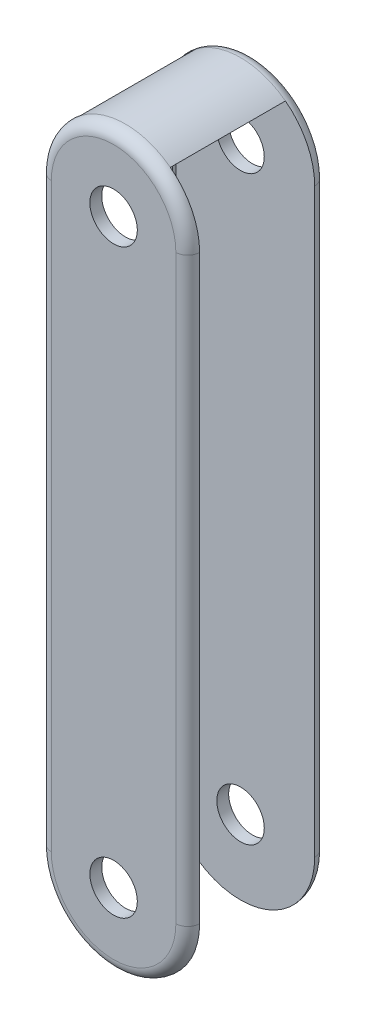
ISO-10303-21;
HEADER;
FILE_DESCRIPTION(('STEP AP214'),'2;1');
FILE_NAME('part.step','',(''),(''),'','','');
FILE_SCHEMA(('AUTOMOTIVE_DESIGN { 1 0 10303 214 1 1 1 1 }'));
ENDSEC;
DATA;
#1=APPLICATION_CONTEXT('core data for automotive mechanical design processes');
#2=APPLICATION_PROTOCOL_DEFINITION('international standard','automotive_design',2000,#1);
#3=PRODUCT_CONTEXT('',#1,'mechanical');
#4=PRODUCT('Part','Part','',(#3));
#5=PRODUCT_RELATED_PRODUCT_CATEGORY('part','',(#4));
#6=PRODUCT_DEFINITION_FORMATION('','',#4);
#7=PRODUCT_DEFINITION_CONTEXT('part definition',#1,'design');
#8=PRODUCT_DEFINITION('design','',#6,#7);
#9=PRODUCT_DEFINITION_SHAPE('','',#8);
#10=(LENGTH_UNIT() NAMED_UNIT(*) SI_UNIT(.MILLI.,.METRE.));
#11=(NAMED_UNIT(*) PLANE_ANGLE_UNIT() SI_UNIT($,.RADIAN.));
#12=(NAMED_UNIT(*) SI_UNIT($,.STERADIAN.) SOLID_ANGLE_UNIT());
#13=UNCERTAINTY_MEASURE_WITH_UNIT(LENGTH_MEASURE(1.E-05),#10,'distance_accuracy_value','');
#14=(GEOMETRIC_REPRESENTATION_CONTEXT(3) GLOBAL_UNCERTAINTY_ASSIGNED_CONTEXT((#13)) GLOBAL_UNIT_ASSIGNED_CONTEXT((#10,
#11,#12)) REPRESENTATION_CONTEXT('',''));
#15=CARTESIAN_POINT('',(0.,0.,0.));
#16=DIRECTION('',(0.,0.,1.));
#17=DIRECTION('',(1.,0.,0.));
#18=AXIS2_PLACEMENT_3D('',#15,#16,#17);
#19=CARTESIAN_POINT('',(6.25,49.,11.7));
#20=DIRECTION('',(0.,0.,-1.));
#21=DIRECTION('',(-1.,0.,0.));
#22=AXIS2_PLACEMENT_3D('',#19,#20,#21);
#23=CYLINDRICAL_SURFACE('',#22,6.25);
#24=DIRECTION('',(0.,0.,-1.));
#25=VECTOR('',#24,1.);
#26=CARTESIAN_POINT('',(0.0723164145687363,49.9480113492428,11.7));
#27=LINE('',#26,#25);
#28=CARTESIAN_POINT('',(0.0723164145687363,49.9480113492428,1.3));
#29=VERTEX_POINT('',#28);
#30=CARTESIAN_POINT('',(0.0723164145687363,49.9480113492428,9.3));
#31=VERTEX_POINT('',#30);
#32=EDGE_CURVE('E296',#29,#31,#27,.F.);
#33=ORIENTED_EDGE('',*,*,#32,.T.);
#34=CARTESIAN_POINT('',(6.25,49.,9.3));
#35=DIRECTION('',(0.,0.,1.));
#36=DIRECTION('',(1.,0.,0.));
#37=AXIS2_PLACEMENT_3D('',#34,#35,#36);
#38=CIRCLE('',#37,6.25);
#39=CARTESIAN_POINT('',(0.,49.,9.3));
#40=VERTEX_POINT('',#39);
#41=EDGE_CURVE('E293',#31,#40,#38,.T.);
#42=ORIENTED_EDGE('',*,*,#41,.T.);
#43=DIRECTION('',(0.,0.,-1.));
#44=VECTOR('',#43,1.);
#45=CARTESIAN_POINT('',(0.,49.,11.7));
#46=LINE('',#45,#44);
#47=CARTESIAN_POINT('',(0.,49.,10.7));
#48=VERTEX_POINT('',#47);
#49=EDGE_CURVE('E322',#48,#40,#46,.T.);
#50=ORIENTED_EDGE('',*,*,#49,.F.);
#51=CARTESIAN_POINT('',(6.25,49.,10.7));
#52=DIRECTION('',(0.,0.,-1.));
#53=DIRECTION('',(-1.,0.,0.));
#54=AXIS2_PLACEMENT_3D('',#51,#52,#53);
#55=CIRCLE('',#54,6.25);
#56=CARTESIAN_POINT('',(0.800000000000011,52.0594117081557,10.7));
#57=VERTEX_POINT('',#56);
#58=EDGE_CURVE('E205',#48,#57,#55,.T.);
#59=ORIENTED_EDGE('',*,*,#58,.T.);
#60=DIRECTION('',(0.,0.,-1.));
#61=VECTOR('',#60,1.);
#62=CARTESIAN_POINT('',(0.800000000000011,52.0594117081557,11.7));
#63=LINE('',#62,#61);
#64=CARTESIAN_POINT('',(0.800000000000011,52.0594117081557,1.));
#65=VERTEX_POINT('',#64);
#66=EDGE_CURVE('E307',#65,#57,#63,.F.);
#67=ORIENTED_EDGE('',*,*,#66,.F.);
#68=CARTESIAN_POINT('',(6.25,49.,1.));
#69=DIRECTION('',(0.,0.,-1.));
#70=DIRECTION('',(-1.,0.,0.));
#71=AXIS2_PLACEMENT_3D('',#68,#69,#70);
#72=CIRCLE('',#71,6.25);
#73=CARTESIAN_POINT('',(0.,49.,1.));
#74=VERTEX_POINT('',#73);
#75=EDGE_CURVE('E233',#65,#74,#72,.F.);
#76=ORIENTED_EDGE('',*,*,#75,.T.);
#77=CARTESIAN_POINT('',(0.,49.,1.3));
#78=VERTEX_POINT('',#77);
#79=EDGE_CURVE('E220',#78,#74,#46,.T.);
#80=ORIENTED_EDGE('',*,*,#79,.F.);
#81=CARTESIAN_POINT('',(6.25,49.,1.3));
#82=DIRECTION('',(0.,0.,-1.));
#83=DIRECTION('',(0.,1.,0.));
#84=AXIS2_PLACEMENT_3D('',#81,#82,#83);
#85=CIRCLE('',#84,6.25);
#86=EDGE_CURVE('E60',#78,#29,#85,.T.);
#87=ORIENTED_EDGE('',*,*,#86,.T.);
#88=EDGE_LOOP('',(#33,#42,#50,#59,#67,#76,#80,#87));
#89=FACE_BOUND('',#88,.T.);
#90=ADVANCED_FACE('F35',(#89),#23,.T.);
#91=CARTESIAN_POINT('',(2.46620715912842,53.9744760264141,10.7));
#92=VERTEX_POINT('',#91);
#93=CARTESIAN_POINT('',(10.0337928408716,53.9744760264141,10.7));
#94=VERTEX_POINT('',#93);
#95=EDGE_CURVE('E204',#92,#94,#55,.T.);
#96=ORIENTED_EDGE('',*,*,#95,.T.);
#97=DIRECTION('',(0.,0.,-1.));
#98=VECTOR('',#97,1.);
#99=CARTESIAN_POINT('',(10.0337928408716,53.9744760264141,11.7));
#100=LINE('',#99,#98);
#101=CARTESIAN_POINT('',(10.0337928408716,53.9744760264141,1.));
#102=VERTEX_POINT('',#101);
#103=EDGE_CURVE('E317',#94,#102,#100,.T.);
#104=ORIENTED_EDGE('',*,*,#103,.T.);
#105=CARTESIAN_POINT('',(2.46620715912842,53.9744760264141,1.));
#106=VERTEX_POINT('',#105);
#107=EDGE_CURVE('E237',#102,#106,#72,.F.);
#108=ORIENTED_EDGE('',*,*,#107,.T.);
#109=DIRECTION('',(0.,0.,-1.));
#110=VECTOR('',#109,1.);
#111=CARTESIAN_POINT('',(2.46620715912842,53.9744760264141,11.7));
#112=LINE('',#111,#110);
#113=EDGE_CURVE('E314',#106,#92,#112,.F.);
#114=ORIENTED_EDGE('',*,*,#113,.T.);
#115=EDGE_LOOP('',(#96,#104,#108,#114));
#116=FACE_BOUND('',#115,.T.);
#117=ADVANCED_FACE('F350',(#116),#23,.T.);
#118=CARTESIAN_POINT('',(0.,0.,11.7));
#119=DIRECTION('',(1.,0.,0.));
#120=DIRECTION('',(0.,0.,-1.));
#121=AXIS2_PLACEMENT_3D('',#118,#119,#120);
#122=PLANE('',#121);
#123=DIRECTION('',(0.,-1.,0.));
#124=VECTOR('',#123,1.);
#125=CARTESIAN_POINT('',(0.,0.,1.));
#126=LINE('',#125,#124);
#127=CARTESIAN_POINT('',(0.,3.54999999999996,1.));
#128=VERTEX_POINT('',#127);
#129=EDGE_CURVE('E189',#74,#128,#126,.T.);
#130=ORIENTED_EDGE('',*,*,#129,.T.);
#131=DIRECTION('',(0.,0.,-1.));
#132=VECTOR('',#131,1.);
#133=CARTESIAN_POINT('',(0.,3.54999999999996,10.7));
#134=LINE('',#133,#132);
#135=CARTESIAN_POINT('',(0.,3.54999999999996,10.7));
#136=VERTEX_POINT('',#135);
#137=EDGE_CURVE('E175',#136,#128,#134,.T.);
#138=ORIENTED_EDGE('',*,*,#137,.F.);
#139=DIRECTION('',(0.,-1.,0.));
#140=VECTOR('',#139,1.);
#141=CARTESIAN_POINT('',(0.,0.,10.7));
#142=LINE('',#141,#140);
#143=EDGE_CURVE('E169',#136,#48,#142,.F.);
#144=ORIENTED_EDGE('',*,*,#143,.T.);
#145=ORIENTED_EDGE('',*,*,#49,.T.);
#146=DIRECTION('',(0.,1.,0.));
#147=VECTOR('',#146,1.);
#148=CARTESIAN_POINT('',(0.,15.15,9.3));
#149=LINE('',#148,#147);
#150=CARTESIAN_POINT('',(0.,15.15,9.3));
#151=VERTEX_POINT('',#150);
#152=EDGE_CURVE('E281',#151,#40,#149,.T.);
#153=ORIENTED_EDGE('',*,*,#152,.F.);
#154=CARTESIAN_POINT('',(0.,15.15,5.3));
#155=DIRECTION('',(-1.,0.,0.));
#156=DIRECTION('',(0.,0.,-1.));
#157=AXIS2_PLACEMENT_3D('',#154,#155,#156);
#158=CIRCLE('',#157,4.);
#159=CARTESIAN_POINT('',(0.,15.15,1.3));
#160=VERTEX_POINT('',#159);
#161=EDGE_CURVE('E278',#160,#151,#158,.T.);
#162=ORIENTED_EDGE('',*,*,#161,.F.);
#163=DIRECTION('',(0.,-1.,0.));
#164=VECTOR('',#163,1.);
#165=CARTESIAN_POINT('',(0.,49.9480113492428,1.3));
#166=LINE('',#165,#164);
#167=EDGE_CURVE('E276',#78,#160,#166,.T.);
#168=ORIENTED_EDGE('',*,*,#167,.F.);
#169=ORIENTED_EDGE('',*,*,#79,.T.);
#170=EDGE_LOOP('',(#130,#138,#144,#145,#153,#162,#168,#169));
#171=FACE_BOUND('',#170,.T.);
#172=ADVANCED_FACE('F185',(#171),#122,.F.);
#173=CARTESIAN_POINT('',(6.25,0.,11.7));
#174=DIRECTION('',(0.,0.,-1.));
#175=DIRECTION('',(-1.,0.,0.));
#176=AXIS2_PLACEMENT_3D('',#173,#174,#175);
#177=PLANE('',#176);
#178=CARTESIAN_POINT('',(6.25,49.,11.7));
#179=DIRECTION('',(0.,0.,1.));
#180=DIRECTION('',(1.,0.,0.));
#181=AXIS2_PLACEMENT_3D('',#178,#179,#180);
#182=CIRCLE('',#181,2.);
#183=CARTESIAN_POINT('',(8.25,49.,11.7));
#184=VERTEX_POINT('',#183);
#185=EDGE_CURVE('E416',#184,#184,#182,.T.);
#186=ORIENTED_EDGE('',*,*,#185,.F.);
#187=EDGE_LOOP('',(#186));
#188=FACE_BOUND('',#187,.T.);
#189=CARTESIAN_POINT('',(6.25,0.,11.7));
#190=DIRECTION('',(0.,0.,1.));
#191=DIRECTION('',(1.,0.,0.));
#192=AXIS2_PLACEMENT_3D('',#189,#190,#191);
#193=CIRCLE('',#192,2.);
#194=CARTESIAN_POINT('',(8.25,0.,11.7));
#195=VERTEX_POINT('',#194);
#196=EDGE_CURVE('E263',#195,#195,#193,.T.);
#197=ORIENTED_EDGE('',*,*,#196,.F.);
#198=EDGE_LOOP('',(#197));
#199=FACE_BOUND('',#198,.T.);
#200=CARTESIAN_POINT('',(6.25,49.,11.7));
#201=DIRECTION('',(0.,0.,-1.));
#202=DIRECTION('',(-1.,0.,0.));
#203=AXIS2_PLACEMENT_3D('',#200,#201,#202);
#204=CIRCLE('',#203,5.25);
#205=CARTESIAN_POINT('',(11.5,49.,11.7));
#206=VERTEX_POINT('',#205);
#207=CARTESIAN_POINT('',(0.999999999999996,49.,11.7));
#208=VERTEX_POINT('',#207);
#209=EDGE_CURVE('E326',#206,#208,#204,.F.);
#210=ORIENTED_EDGE('',*,*,#209,.T.);
#211=DIRECTION('',(0.,-1.,0.));
#212=VECTOR('',#211,1.);
#213=CARTESIAN_POINT('',(1.,0.,11.7));
#214=LINE('',#213,#212);
#215=CARTESIAN_POINT('',(0.999999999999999,0.,11.7));
#216=VERTEX_POINT('',#215);
#217=EDGE_CURVE('E197',#208,#216,#214,.T.);
#218=ORIENTED_EDGE('',*,*,#217,.T.);
#219=CARTESIAN_POINT('',(6.25,0.,11.7));
#220=DIRECTION('',(0.,0.,-1.));
#221=DIRECTION('',(-1.,0.,0.));
#222=AXIS2_PLACEMENT_3D('',#219,#220,#221);
#223=CIRCLE('',#222,5.25000000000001);
#224=CARTESIAN_POINT('',(11.5,0.,11.7));
#225=VERTEX_POINT('',#224);
#226=EDGE_CURVE('E199',#216,#225,#223,.F.);
#227=ORIENTED_EDGE('',*,*,#226,.T.);
#228=DIRECTION('',(0.,1.,0.));
#229=VECTOR('',#228,1.);
#230=CARTESIAN_POINT('',(11.5,0.,11.7));
#231=LINE('',#230,#229);
#232=EDGE_CURVE('E324',#225,#206,#231,.T.);
#233=ORIENTED_EDGE('',*,*,#232,.T.);
#234=EDGE_LOOP('',(#210,#218,#227,#233));
#235=FACE_BOUND('',#234,.T.);
#236=ADVANCED_FACE('F330',(#188,#199,#235),#177,.F.);
#237=CARTESIAN_POINT('',(6.25,0.,0.));
#238=DIRECTION('',(0.,0.,-1.));
#239=DIRECTION('',(-1.,0.,0.));
#240=AXIS2_PLACEMENT_3D('',#237,#238,#239);
#241=PLANE('',#240);
#242=CARTESIAN_POINT('',(6.25,49.,0.));
#243=DIRECTION('',(0.,0.,1.));
#244=DIRECTION('',(1.,0.,0.));
#245=AXIS2_PLACEMENT_3D('',#242,#243,#244);
#246=CIRCLE('',#245,2.);
#247=CARTESIAN_POINT('',(8.25,49.,0.));
#248=VERTEX_POINT('',#247);
#249=EDGE_CURVE('E420',#248,#248,#246,.T.);
#250=ORIENTED_EDGE('',*,*,#249,.T.);
#251=EDGE_LOOP('',(#250));
#252=FACE_BOUND('',#251,.T.);
#253=CARTESIAN_POINT('',(6.25,0.,0.));
#254=DIRECTION('',(0.,0.,1.));
#255=DIRECTION('',(1.,0.,0.));
#256=AXIS2_PLACEMENT_3D('',#253,#254,#255);
#257=CIRCLE('',#256,2.);
#258=CARTESIAN_POINT('',(8.25,0.,0.));
#259=VERTEX_POINT('',#258);
#260=EDGE_CURVE('E257',#259,#259,#257,.T.);
#261=ORIENTED_EDGE('',*,*,#260,.T.);
#262=EDGE_LOOP('',(#261));
#263=FACE_BOUND('',#262,.T.);
#264=CARTESIAN_POINT('',(6.25,0.,0.));
#265=DIRECTION('',(0.,0.,-1.));
#266=DIRECTION('',(-1.,0.,0.));
#267=AXIS2_PLACEMENT_3D('',#264,#265,#266);
#268=CIRCLE('',#267,5.25000000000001);
#269=CARTESIAN_POINT('',(11.5,0.,0.));
#270=VERTEX_POINT('',#269);
#271=CARTESIAN_POINT('',(0.999999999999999,0.,0.));
#272=VERTEX_POINT('',#271);
#273=EDGE_CURVE('E226',#270,#272,#268,.T.);
#274=ORIENTED_EDGE('',*,*,#273,.T.);
#275=DIRECTION('',(0.,-1.,0.));
#276=VECTOR('',#275,1.);
#277=CARTESIAN_POINT('',(1.,49.,0.));
#278=LINE('',#277,#276);
#279=CARTESIAN_POINT('',(0.999999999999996,49.,0.));
#280=VERTEX_POINT('',#279);
#281=EDGE_CURVE('E228',#272,#280,#278,.F.);
#282=ORIENTED_EDGE('',*,*,#281,.T.);
#283=CARTESIAN_POINT('',(6.25,49.,0.));
#284=DIRECTION('',(0.,0.,-1.));
#285=DIRECTION('',(-1.,0.,0.));
#286=AXIS2_PLACEMENT_3D('',#283,#284,#285);
#287=CIRCLE('',#286,5.25);
#288=CARTESIAN_POINT('',(11.5,49.,0.));
#289=VERTEX_POINT('',#288);
#290=EDGE_CURVE('E224',#280,#289,#287,.T.);
#291=ORIENTED_EDGE('',*,*,#290,.T.);
#292=DIRECTION('',(0.,1.,0.));
#293=VECTOR('',#292,1.);
#294=CARTESIAN_POINT('',(11.5,0.,0.));
#295=LINE('',#294,#293);
#296=EDGE_CURVE('E222',#289,#270,#295,.F.);
#297=ORIENTED_EDGE('',*,*,#296,.T.);
#298=EDGE_LOOP('',(#274,#282,#291,#297));
#299=FACE_BOUND('',#298,.T.);
#300=ADVANCED_FACE('F360',(#252,#263,#299),#241,.T.);
#301=CARTESIAN_POINT('',(11.5,0.,10.7));
#302=DIRECTION('',(0.,1.,0.));
#303=DIRECTION('',(-1.,0.,0.));
#304=AXIS2_PLACEMENT_3D('',#301,#302,#303);
#305=CYLINDRICAL_SURFACE('',#304,1.);
#306=CARTESIAN_POINT('',(11.5,0.,10.7));
#307=DIRECTION('',(0.,-1.,0.));
#308=DIRECTION('',(1.,0.,0.));
#309=AXIS2_PLACEMENT_3D('',#306,#307,#308);
#310=CIRCLE('',#309,1.);
#311=CARTESIAN_POINT('',(12.5,0.,10.7));
#312=VERTEX_POINT('',#311);
#313=EDGE_CURVE('E214',#312,#225,#310,.T.);
#314=ORIENTED_EDGE('',*,*,#313,.F.);
#315=DIRECTION('',(0.,1.,0.));
#316=VECTOR('',#315,1.);
#317=CARTESIAN_POINT('',(12.5,49.,10.7));
#318=LINE('',#317,#316);
#319=CARTESIAN_POINT('',(12.5,49.,10.7));
#320=VERTEX_POINT('',#319);
#321=EDGE_CURVE('E208',#320,#312,#318,.F.);
#322=ORIENTED_EDGE('',*,*,#321,.F.);
#323=CARTESIAN_POINT('',(11.5,49.,10.7));
#324=DIRECTION('',(0.,1.,0.));
#325=DIRECTION('',(0.,0.,1.));
#326=AXIS2_PLACEMENT_3D('',#323,#324,#325);
#327=CIRCLE('',#326,1.);
#328=EDGE_CURVE('E217',#206,#320,#327,.T.);
#329=ORIENTED_EDGE('',*,*,#328,.F.);
#330=ORIENTED_EDGE('',*,*,#232,.F.);
#331=EDGE_LOOP('',(#314,#322,#329,#330));
#332=FACE_BOUND('',#331,.T.);
#333=ADVANCED_FACE('F335',(#332),#305,.T.);
#334=CARTESIAN_POINT('',(6.25,49.,10.7));
#335=DIRECTION('',(0.,0.,-1.));
#336=DIRECTION('',(-1.,0.,0.));
#337=AXIS2_PLACEMENT_3D('',#334,#335,#336);
#338=TOROIDAL_SURFACE('',#337,5.25,1.);
#339=ORIENTED_EDGE('',*,*,#328,.T.);
#340=CARTESIAN_POINT('',(6.25,49.,10.7));
#341=DIRECTION('',(0.,0.,1.));
#342=DIRECTION('',(0.,-1.,0.));
#343=AXIS2_PLACEMENT_3D('',#340,#341,#342);
#344=CIRCLE('',#343,6.25);
#345=EDGE_CURVE('E320',#94,#320,#344,.F.);
#346=ORIENTED_EDGE('',*,*,#345,.F.);
#347=ORIENTED_EDGE('',*,*,#95,.F.);
#348=EDGE_CURVE('E244',#57,#92,#344,.F.);
#349=ORIENTED_EDGE('',*,*,#348,.F.);
#350=ORIENTED_EDGE('',*,*,#58,.F.);
#351=CARTESIAN_POINT('',(0.999999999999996,49.,10.7));
#352=DIRECTION('',(0.,-1.,0.));
#353=DIRECTION('',(0.,0.,-1.));
#354=AXIS2_PLACEMENT_3D('',#351,#352,#353);
#355=CIRCLE('',#354,1.);
#356=EDGE_CURVE('E195',#208,#48,#355,.T.);
#357=ORIENTED_EDGE('',*,*,#356,.F.);
#358=ORIENTED_EDGE('',*,*,#209,.F.);
#359=EDGE_LOOP('',(#339,#346,#347,#349,#350,#357,#358));
#360=FACE_BOUND('',#359,.T.);
#361=ADVANCED_FACE('F340',(#360),#338,.T.);
#362=CARTESIAN_POINT('',(6.25,0.,10.7));
#363=DIRECTION('',(0.,0.,-1.));
#364=DIRECTION('',(-1.,0.,0.));
#365=AXIS2_PLACEMENT_3D('',#362,#363,#364);
#366=TOROIDAL_SURFACE('',#365,5.25000000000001,1.);
#367=ORIENTED_EDGE('',*,*,#313,.T.);
#368=ORIENTED_EDGE('',*,*,#226,.F.);
#369=CARTESIAN_POINT('',(0.999999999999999,0.,10.7));
#370=DIRECTION('',(0.,1.,0.));
#371=DIRECTION('',(0.,0.,1.));
#372=AXIS2_PLACEMENT_3D('',#369,#370,#371);
#373=CIRCLE('',#372,1.);
#374=CARTESIAN_POINT('',(0.,0.,10.7));
#375=VERTEX_POINT('',#374);
#376=EDGE_CURVE('E210',#375,#216,#373,.T.);
#377=ORIENTED_EDGE('',*,*,#376,.F.);
#378=CARTESIAN_POINT('',(6.25,0.,10.7));
#379=DIRECTION('',(0.,0.,-1.));
#380=DIRECTION('',(-1.,0.,0.));
#381=AXIS2_PLACEMENT_3D('',#378,#379,#380);
#382=CIRCLE('',#381,6.25000000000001);
#383=EDGE_CURVE('E165',#312,#375,#382,.T.);
#384=ORIENTED_EDGE('',*,*,#383,.F.);
#385=EDGE_LOOP('',(#367,#368,#377,#384));
#386=FACE_BOUND('',#385,.T.);
#387=ADVANCED_FACE('F338',(#386),#366,.T.);
#388=CARTESIAN_POINT('',(1.,0.,10.7));
#389=DIRECTION('',(0.,-1.,0.));
#390=DIRECTION('',(0.,0.,-1.));
#391=AXIS2_PLACEMENT_3D('',#388,#389,#390);
#392=CYLINDRICAL_SURFACE('',#391,1.);
#393=ORIENTED_EDGE('',*,*,#356,.T.);
#394=ORIENTED_EDGE('',*,*,#143,.F.);
#395=EDGE_CURVE('E162',#375,#136,#142,.F.);
#396=ORIENTED_EDGE('',*,*,#395,.F.);
#397=ORIENTED_EDGE('',*,*,#376,.T.);
#398=ORIENTED_EDGE('',*,*,#217,.F.);
#399=EDGE_LOOP('',(#393,#394,#396,#397,#398));
#400=FACE_BOUND('',#399,.T.);
#401=ADVANCED_FACE('F192',(#400),#392,.T.);
#402=CARTESIAN_POINT('',(11.5,49.,1.));
#403=DIRECTION('',(0.,-1.,0.));
#404=DIRECTION('',(1.,0.,0.));
#405=AXIS2_PLACEMENT_3D('',#402,#403,#404);
#406=CYLINDRICAL_SURFACE('',#405,1.);
#407=CARTESIAN_POINT('',(11.5,0.,1.));
#408=DIRECTION('',(0.,-1.,0.));
#409=DIRECTION('',(1.,0.,0.));
#410=AXIS2_PLACEMENT_3D('',#407,#408,#409);
#411=CIRCLE('',#410,1.);
#412=CARTESIAN_POINT('',(12.5,0.,1.));
#413=VERTEX_POINT('',#412);
#414=EDGE_CURVE('E246',#270,#413,#411,.T.);
#415=ORIENTED_EDGE('',*,*,#414,.F.);
#416=ORIENTED_EDGE('',*,*,#296,.F.);
#417=CARTESIAN_POINT('',(11.5,49.,1.));
#418=DIRECTION('',(0.,1.,0.));
#419=DIRECTION('',(0.,0.,1.));
#420=AXIS2_PLACEMENT_3D('',#417,#418,#419);
#421=CIRCLE('',#420,1.);
#422=CARTESIAN_POINT('',(12.5,49.,1.));
#423=VERTEX_POINT('',#422);
#424=EDGE_CURVE('E212',#423,#289,#421,.T.);
#425=ORIENTED_EDGE('',*,*,#424,.F.);
#426=DIRECTION('',(0.,1.,0.));
#427=VECTOR('',#426,1.);
#428=CARTESIAN_POINT('',(12.5,49.,1.));
#429=LINE('',#428,#427);
#430=EDGE_CURVE('E236',#413,#423,#429,.T.);
#431=ORIENTED_EDGE('',*,*,#430,.F.);
#432=EDGE_LOOP('',(#415,#416,#425,#431));
#433=FACE_BOUND('',#432,.T.);
#434=ADVANCED_FACE('F37',(#433),#406,.T.);
#435=CARTESIAN_POINT('',(6.25,49.,1.));
#436=DIRECTION('',(0.,0.,-1.));
#437=DIRECTION('',(-1.,0.,0.));
#438=AXIS2_PLACEMENT_3D('',#435,#436,#437);
#439=TOROIDAL_SURFACE('',#438,5.25,1.);
#440=ORIENTED_EDGE('',*,*,#424,.T.);
#441=ORIENTED_EDGE('',*,*,#290,.F.);
#442=CARTESIAN_POINT('',(0.999999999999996,49.,1.));
#443=DIRECTION('',(0.,-1.,0.));
#444=DIRECTION('',(0.,0.,-1.));
#445=AXIS2_PLACEMENT_3D('',#442,#443,#444);
#446=CIRCLE('',#445,1.);
#447=EDGE_CURVE('E243',#74,#280,#446,.T.);
#448=ORIENTED_EDGE('',*,*,#447,.F.);
#449=ORIENTED_EDGE('',*,*,#75,.F.);
#450=CARTESIAN_POINT('',(6.25,49.,1.));
#451=DIRECTION('',(0.,0.,-1.));
#452=DIRECTION('',(-1.,0.,0.));
#453=AXIS2_PLACEMENT_3D('',#450,#451,#452);
#454=CIRCLE('',#453,6.25);
#455=EDGE_CURVE('E311',#106,#65,#454,.F.);
#456=ORIENTED_EDGE('',*,*,#455,.F.);
#457=ORIENTED_EDGE('',*,*,#107,.F.);
#458=EDGE_CURVE('E234',#423,#102,#72,.F.);
#459=ORIENTED_EDGE('',*,*,#458,.F.);
#460=EDGE_LOOP('',(#440,#441,#448,#449,#456,#457,#459));
#461=FACE_BOUND('',#460,.T.);
#462=ADVANCED_FACE('F446',(#461),#439,.T.);
#463=CARTESIAN_POINT('',(6.25,0.,1.));
#464=DIRECTION('',(0.,0.,-1.));
#465=DIRECTION('',(-1.,0.,0.));
#466=AXIS2_PLACEMENT_3D('',#463,#464,#465);
#467=TOROIDAL_SURFACE('',#466,5.25000000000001,1.);
#468=ORIENTED_EDGE('',*,*,#414,.T.);
#469=CARTESIAN_POINT('',(6.25,0.,1.));
#470=DIRECTION('',(0.,0.,-1.));
#471=DIRECTION('',(-1.,0.,0.));
#472=AXIS2_PLACEMENT_3D('',#469,#470,#471);
#473=CIRCLE('',#472,6.25000000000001);
#474=CARTESIAN_POINT('',(0.,0.,1.));
#475=VERTEX_POINT('',#474);
#476=EDGE_CURVE('E231',#475,#413,#473,.F.);
#477=ORIENTED_EDGE('',*,*,#476,.F.);
#478=CARTESIAN_POINT('',(0.999999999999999,0.,1.));
#479=DIRECTION('',(0.,1.,0.));
#480=DIRECTION('',(0.,0.,1.));
#481=AXIS2_PLACEMENT_3D('',#478,#479,#480);
#482=CIRCLE('',#481,1.);
#483=EDGE_CURVE('E240',#272,#475,#482,.T.);
#484=ORIENTED_EDGE('',*,*,#483,.F.);
#485=ORIENTED_EDGE('',*,*,#273,.F.);
#486=EDGE_LOOP('',(#468,#477,#484,#485));
#487=FACE_BOUND('',#486,.T.);
#488=ADVANCED_FACE('F437',(#487),#467,.T.);
#489=CARTESIAN_POINT('',(1.,0.,1.));
#490=DIRECTION('',(0.,1.,0.));
#491=DIRECTION('',(0.,0.,1.));
#492=AXIS2_PLACEMENT_3D('',#489,#490,#491);
#493=CYLINDRICAL_SURFACE('',#492,1.);
#494=ORIENTED_EDGE('',*,*,#447,.T.);
#495=ORIENTED_EDGE('',*,*,#281,.F.);
#496=ORIENTED_EDGE('',*,*,#483,.T.);
#497=DIRECTION('',(0.,-1.,0.));
#498=VECTOR('',#497,1.);
#499=CARTESIAN_POINT('',(0.,3.54999999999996,1.));
#500=LINE('',#499,#498);
#501=EDGE_CURVE('E181',#128,#475,#500,.T.);
#502=ORIENTED_EDGE('',*,*,#501,.F.);
#503=ORIENTED_EDGE('',*,*,#129,.F.);
#504=EDGE_LOOP('',(#494,#495,#496,#502,#503));
#505=FACE_BOUND('',#504,.T.);
#506=ADVANCED_FACE('F376',(#505),#493,.T.);
#507=CARTESIAN_POINT('',(0.800000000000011,53.9744760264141,1.));
#508=DIRECTION('',(0.,1.,0.));
#509=DIRECTION('',(-1.,0.,0.));
#510=AXIS2_PLACEMENT_3D('',#507,#508,#509);
#511=PLANE('',#510);
#512=DIRECTION('',(1.,0.,0.));
#513=VECTOR('',#512,1.);
#514=CARTESIAN_POINT('',(0.800000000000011,53.9744760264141,10.7));
#515=LINE('',#514,#513);
#516=EDGE_CURVE('E304',#92,#94,#515,.T.);
#517=ORIENTED_EDGE('',*,*,#516,.F.);
#518=ORIENTED_EDGE('',*,*,#113,.F.);
#519=DIRECTION('',(1.,0.,0.));
#520=VECTOR('',#519,1.);
#521=CARTESIAN_POINT('',(0.800000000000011,53.9744760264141,1.));
#522=LINE('',#521,#520);
#523=EDGE_CURVE('E303',#106,#102,#522,.T.);
#524=ORIENTED_EDGE('',*,*,#523,.T.);
#525=ORIENTED_EDGE('',*,*,#103,.F.);
#526=EDGE_LOOP('',(#517,#518,#524,#525));
#527=FACE_BOUND('',#526,.T.);
#528=ADVANCED_FACE('F372',(#527),#511,.F.);
#529=CARTESIAN_POINT('',(0.800000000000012,-11.1264427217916,1.));
#530=DIRECTION('',(1.,0.,0.));
#531=DIRECTION('',(0.,1.,0.));
#532=AXIS2_PLACEMENT_3D('',#529,#530,#531);
#533=PLANE('',#532);
#534=DIRECTION('',(0.,0.,1.));
#535=VECTOR('',#534,1.);
#536=CARTESIAN_POINT('',(0.800000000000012,3.54999999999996,1.));
#537=LINE('',#536,#535);
#538=CARTESIAN_POINT('',(0.800000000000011,3.54999999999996,1.));
#539=VERTEX_POINT('',#538);
#540=CARTESIAN_POINT('',(0.800000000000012,3.54999999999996,10.7));
#541=VERTEX_POINT('',#540);
#542=EDGE_CURVE('E178',#539,#541,#537,.T.);
#543=ORIENTED_EDGE('',*,*,#542,.F.);
#544=DIRECTION('',(0.,1.,0.));
#545=VECTOR('',#544,1.);
#546=CARTESIAN_POINT('',(0.800000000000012,-11.1264427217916,1.));
#547=LINE('',#546,#545);
#548=EDGE_CURVE('E299',#539,#65,#547,.T.);
#549=ORIENTED_EDGE('',*,*,#548,.T.);
#550=ORIENTED_EDGE('',*,*,#66,.T.);
#551=DIRECTION('',(0.,-1.,0.));
#552=VECTOR('',#551,1.);
#553=CARTESIAN_POINT('',(0.800000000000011,53.9744760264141,10.7));
#554=LINE('',#553,#552);
#555=EDGE_CURVE('E301',#57,#541,#554,.T.);
#556=ORIENTED_EDGE('',*,*,#555,.T.);
#557=EDGE_LOOP('',(#543,#549,#550,#556));
#558=FACE_BOUND('',#557,.T.);
#559=DIRECTION('',(0.,0.,1.));
#560=VECTOR('',#559,1.);
#561=CARTESIAN_POINT('',(0.800000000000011,49.9480113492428,1.));
#562=LINE('',#561,#560);
#563=CARTESIAN_POINT('',(0.800000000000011,49.9480113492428,1.3));
#564=VERTEX_POINT('',#563);
#565=CARTESIAN_POINT('',(0.800000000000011,49.9480113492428,9.3));
#566=VERTEX_POINT('',#565);
#567=EDGE_CURVE('E11',#564,#566,#562,.T.);
#568=ORIENTED_EDGE('',*,*,#567,.F.);
#569=DIRECTION('',(0.,1.,0.));
#570=VECTOR('',#569,1.);
#571=CARTESIAN_POINT('',(0.800000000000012,-11.1264427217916,1.3));
#572=LINE('',#571,#570);
#573=CARTESIAN_POINT('',(0.800000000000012,15.15,1.3));
#574=VERTEX_POINT('',#573);
#575=EDGE_CURVE('E239',#574,#564,#572,.T.);
#576=ORIENTED_EDGE('',*,*,#575,.F.);
#577=CARTESIAN_POINT('',(0.800000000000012,15.15,5.3));
#578=DIRECTION('',(1.,0.,0.));
#579=DIRECTION('',(0.,1.,0.));
#580=AXIS2_PLACEMENT_3D('',#577,#578,#579);
#581=CIRCLE('',#580,4.);
#582=CARTESIAN_POINT('',(0.800000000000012,15.15,9.3));
#583=VERTEX_POINT('',#582);
#584=EDGE_CURVE('E252',#583,#574,#581,.T.);
#585=ORIENTED_EDGE('',*,*,#584,.F.);
#586=DIRECTION('',(0.,-1.,0.));
#587=VECTOR('',#586,1.);
#588=CARTESIAN_POINT('',(0.800000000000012,-11.1264427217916,9.3));
#589=LINE('',#588,#587);
#590=EDGE_CURVE('E44',#566,#583,#589,.T.);
#591=ORIENTED_EDGE('',*,*,#590,.F.);
#592=EDGE_LOOP('',(#568,#576,#585,#591));
#593=FACE_BOUND('',#592,.T.);
#594=ADVANCED_FACE('F375',(#558,#593),#533,.T.);
#595=CARTESIAN_POINT('',(0.800000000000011,53.9744760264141,10.7));
#596=DIRECTION('',(0.,0.,1.));
#597=DIRECTION('',(0.,-1.,0.));
#598=AXIS2_PLACEMENT_3D('',#595,#596,#597);
#599=PLANE('',#598);
#600=CARTESIAN_POINT('',(6.25,49.,10.7));
#601=DIRECTION('',(0.,0.,1.));
#602=DIRECTION('',(0.,-1.,0.));
#603=AXIS2_PLACEMENT_3D('',#600,#601,#602);
#604=CIRCLE('',#603,2.);
#605=CARTESIAN_POINT('',(6.25,47.,10.7));
#606=VERTEX_POINT('',#605);
#607=EDGE_CURVE('E268',#606,#606,#604,.T.);
#608=ORIENTED_EDGE('',*,*,#607,.T.);
#609=EDGE_LOOP('',(#608));
#610=FACE_BOUND('',#609,.T.);
#611=CARTESIAN_POINT('',(6.25,0.,10.7));
#612=DIRECTION('',(0.,0.,1.));
#613=DIRECTION('',(0.,-1.,0.));
#614=AXIS2_PLACEMENT_3D('',#611,#612,#613);
#615=CIRCLE('',#614,2.);
#616=CARTESIAN_POINT('',(6.25,-2.,10.7));
#617=VERTEX_POINT('',#616);
#618=EDGE_CURVE('E190',#617,#617,#615,.T.);
#619=ORIENTED_EDGE('',*,*,#618,.T.);
#620=EDGE_LOOP('',(#619));
#621=FACE_BOUND('',#620,.T.);
#622=ORIENTED_EDGE('',*,*,#383,.T.);
#623=ORIENTED_EDGE('',*,*,#395,.T.);
#624=DIRECTION('',(-1.,0.,0.));
#625=VECTOR('',#624,1.);
#626=CARTESIAN_POINT('',(11.7,3.54999999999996,10.7));
#627=LINE('',#626,#625);
#628=EDGE_CURVE('E52',#541,#136,#627,.T.);
#629=ORIENTED_EDGE('',*,*,#628,.F.);
#630=ORIENTED_EDGE('',*,*,#555,.F.);
#631=ORIENTED_EDGE('',*,*,#348,.T.);
#632=ORIENTED_EDGE('',*,*,#516,.T.);
#633=ORIENTED_EDGE('',*,*,#345,.T.);
#634=ORIENTED_EDGE('',*,*,#321,.T.);
#635=EDGE_LOOP('',(#622,#623,#629,#630,#631,#632,#633,#634));
#636=FACE_BOUND('',#635,.T.);
#637=ADVANCED_FACE('F163',(#610,#621,#636),#599,.F.);
#638=CARTESIAN_POINT('',(0.800000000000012,-11.1264427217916,1.));
#639=DIRECTION('',(0.,0.,-1.));
#640=DIRECTION('',(-1.,0.,0.));
#641=AXIS2_PLACEMENT_3D('',#638,#639,#640);
#642=PLANE('',#641);
#643=CARTESIAN_POINT('',(6.25,49.,1.));
#644=DIRECTION('',(0.,0.,-1.));
#645=DIRECTION('',(-1.,0.,0.));
#646=AXIS2_PLACEMENT_3D('',#643,#644,#645);
#647=CIRCLE('',#646,2.);
#648=CARTESIAN_POINT('',(4.25,49.,1.));
#649=VERTEX_POINT('',#648);
#650=EDGE_CURVE('E39',#649,#649,#647,.T.);
#651=ORIENTED_EDGE('',*,*,#650,.T.);
#652=EDGE_LOOP('',(#651));
#653=FACE_BOUND('',#652,.T.);
#654=CARTESIAN_POINT('',(6.25,0.,1.));
#655=DIRECTION('',(0.,0.,-1.));
#656=DIRECTION('',(-1.,0.,0.));
#657=AXIS2_PLACEMENT_3D('',#654,#655,#656);
#658=CIRCLE('',#657,2.);
#659=CARTESIAN_POINT('',(4.25000000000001,0.,1.));
#660=VERTEX_POINT('',#659);
#661=EDGE_CURVE('E255',#660,#660,#658,.T.);
#662=ORIENTED_EDGE('',*,*,#661,.T.);
#663=EDGE_LOOP('',(#662));
#664=FACE_BOUND('',#663,.T.);
#665=ORIENTED_EDGE('',*,*,#548,.F.);
#666=DIRECTION('',(-1.,0.,0.));
#667=VECTOR('',#666,1.);
#668=CARTESIAN_POINT('',(11.7,3.54999999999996,1.));
#669=LINE('',#668,#667);
#670=EDGE_CURVE('E180',#539,#128,#669,.T.);
#671=ORIENTED_EDGE('',*,*,#670,.T.);
#672=ORIENTED_EDGE('',*,*,#501,.T.);
#673=ORIENTED_EDGE('',*,*,#476,.T.);
#674=ORIENTED_EDGE('',*,*,#430,.T.);
#675=ORIENTED_EDGE('',*,*,#458,.T.);
#676=ORIENTED_EDGE('',*,*,#523,.F.);
#677=ORIENTED_EDGE('',*,*,#455,.T.);
#678=EDGE_LOOP('',(#665,#671,#672,#673,#674,#675,#676,#677));
#679=FACE_BOUND('',#678,.T.);
#680=ADVANCED_FACE('F367',(#653,#664,#679),#642,.F.);
#681=CARTESIAN_POINT('',(11.7,49.9480113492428,9.3));
#682=DIRECTION('',(0.,1.,0.));
#683=DIRECTION('',(0.,0.,1.));
#684=AXIS2_PLACEMENT_3D('',#681,#682,#683);
#685=PLANE('',#684);
#686=DIRECTION('',(-1.,0.,0.));
#687=VECTOR('',#686,1.);
#688=CARTESIAN_POINT('',(11.7,49.9480113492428,1.3));
#689=LINE('',#688,#687);
#690=EDGE_CURVE('E283',#564,#29,#689,.T.);
#691=ORIENTED_EDGE('',*,*,#690,.F.);
#692=ORIENTED_EDGE('',*,*,#567,.T.);
#693=DIRECTION('',(-1.,0.,0.));
#694=VECTOR('',#693,1.);
#695=CARTESIAN_POINT('',(11.7,49.9480113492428,9.3));
#696=LINE('',#695,#694);
#697=EDGE_CURVE('E284',#566,#31,#696,.T.);
#698=ORIENTED_EDGE('',*,*,#697,.T.);
#699=ORIENTED_EDGE('',*,*,#32,.F.);
#700=EDGE_LOOP('',(#691,#692,#698,#699));
#701=FACE_BOUND('',#700,.T.);
#702=ADVANCED_FACE('F370',(#701),#685,.F.);
#703=CARTESIAN_POINT('',(11.7,15.15,9.3));
#704=DIRECTION('',(0.,0.,1.));
#705=DIRECTION('',(1.,0.,0.));
#706=AXIS2_PLACEMENT_3D('',#703,#704,#705);
#707=PLANE('',#706);
#708=ORIENTED_EDGE('',*,*,#697,.F.);
#709=ORIENTED_EDGE('',*,*,#590,.T.);
#710=DIRECTION('',(-1.,0.,0.));
#711=VECTOR('',#710,1.);
#712=CARTESIAN_POINT('',(11.7,15.15,9.3));
#713=LINE('',#712,#711);
#714=EDGE_CURVE('E287',#583,#151,#713,.T.);
#715=ORIENTED_EDGE('',*,*,#714,.T.);
#716=ORIENTED_EDGE('',*,*,#152,.T.);
#717=ORIENTED_EDGE('',*,*,#41,.F.);
#718=EDGE_LOOP('',(#708,#709,#715,#716,#717));
#719=FACE_BOUND('',#718,.T.);
#720=ADVANCED_FACE('F386',(#719),#707,.F.);
#721=CARTESIAN_POINT('',(11.7,49.9480113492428,1.3));
#722=DIRECTION('',(0.,0.,-1.));
#723=DIRECTION('',(0.,1.,0.));
#724=AXIS2_PLACEMENT_3D('',#721,#722,#723);
#725=PLANE('',#724);
#726=ORIENTED_EDGE('',*,*,#167,.T.);
#727=DIRECTION('',(-1.,0.,0.));
#728=VECTOR('',#727,1.);
#729=CARTESIAN_POINT('',(11.7,15.15,1.3));
#730=LINE('',#729,#728);
#731=EDGE_CURVE('E289',#574,#160,#730,.T.);
#732=ORIENTED_EDGE('',*,*,#731,.F.);
#733=ORIENTED_EDGE('',*,*,#575,.T.);
#734=ORIENTED_EDGE('',*,*,#690,.T.);
#735=ORIENTED_EDGE('',*,*,#86,.F.);
#736=EDGE_LOOP('',(#726,#732,#733,#734,#735));
#737=FACE_BOUND('',#736,.T.);
#738=ADVANCED_FACE('F388',(#737),#725,.F.);
#739=CARTESIAN_POINT('',(11.7,15.15,5.3));
#740=DIRECTION('',(-1.,0.,0.));
#741=DIRECTION('',(0.,0.,1.));
#742=AXIS2_PLACEMENT_3D('',#739,#740,#741);
#743=CYLINDRICAL_SURFACE('',#742,4.);
#744=ORIENTED_EDGE('',*,*,#584,.T.);
#745=ORIENTED_EDGE('',*,*,#731,.T.);
#746=ORIENTED_EDGE('',*,*,#161,.T.);
#747=ORIENTED_EDGE('',*,*,#714,.F.);
#748=EDGE_LOOP('',(#744,#745,#746,#747));
#749=FACE_BOUND('',#748,.T.);
#750=ADVANCED_FACE('F391',(#749),#743,.F.);
#751=CARTESIAN_POINT('',(11.7,3.54999999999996,10.7));
#752=DIRECTION('',(0.,1.,0.));
#753=DIRECTION('',(0.,0.,1.));
#754=AXIS2_PLACEMENT_3D('',#751,#752,#753);
#755=PLANE('',#754);
#756=ORIENTED_EDGE('',*,*,#542,.T.);
#757=ORIENTED_EDGE('',*,*,#628,.T.);
#758=ORIENTED_EDGE('',*,*,#137,.T.);
#759=ORIENTED_EDGE('',*,*,#670,.F.);
#760=EDGE_LOOP('',(#756,#757,#758,#759));
#761=FACE_BOUND('',#760,.T.);
#762=ADVANCED_FACE('F174',(#761),#755,.F.);
#763=CARTESIAN_POINT('',(6.25,0.,0.));
#764=DIRECTION('',(0.,0.,1.));
#765=DIRECTION('',(1.,0.,0.));
#766=AXIS2_PLACEMENT_3D('',#763,#764,#765);
#767=CYLINDRICAL_SURFACE('',#766,2.);
#768=ORIENTED_EDGE('',*,*,#260,.F.);
#769=EDGE_LOOP('',(#768));
#770=FACE_BOUND('',#769,.T.);
#771=ORIENTED_EDGE('',*,*,#661,.F.);
#772=EDGE_LOOP('',(#771));
#773=FACE_BOUND('',#772,.T.);
#774=ADVANCED_FACE('F400',(#770,#773),#767,.F.);
#775=ORIENTED_EDGE('',*,*,#196,.T.);
#776=EDGE_LOOP('',(#775));
#777=FACE_BOUND('',#776,.T.);
#778=ORIENTED_EDGE('',*,*,#618,.F.);
#779=EDGE_LOOP('',(#778));
#780=FACE_BOUND('',#779,.T.);
#781=ADVANCED_FACE('F401',(#777,#780),#767,.F.);
#782=CARTESIAN_POINT('',(6.25,49.,0.));
#783=DIRECTION('',(0.,0.,1.));
#784=DIRECTION('',(1.,0.,0.));
#785=AXIS2_PLACEMENT_3D('',#782,#783,#784);
#786=CYLINDRICAL_SURFACE('',#785,2.);
#787=ORIENTED_EDGE('',*,*,#249,.F.);
#788=EDGE_LOOP('',(#787));
#789=FACE_BOUND('',#788,.T.);
#790=ORIENTED_EDGE('',*,*,#650,.F.);
#791=EDGE_LOOP('',(#790));
#792=FACE_BOUND('',#791,.T.);
#793=ADVANCED_FACE('F404',(#789,#792),#786,.F.);
#794=ORIENTED_EDGE('',*,*,#185,.T.);
#795=EDGE_LOOP('',(#794));
#796=FACE_BOUND('',#795,.T.);
#797=ORIENTED_EDGE('',*,*,#607,.F.);
#798=EDGE_LOOP('',(#797));
#799=FACE_BOUND('',#798,.T.);
#800=ADVANCED_FACE('F406',(#796,#799),#786,.F.);
#801=CLOSED_SHELL('',(#90,#117,#172,#236,#300,#333,#361,#387,#401,#434,#462,#488,#506,#528,#594,
#637,#680,#702,#720,#738,#750,#762,#774,#781,#793,#800));
#802=MANIFOLD_SOLID_BREP('B2',#801);
#803=ADVANCED_BREP_SHAPE_REPRESENTATION('',(#18,#802),#14);
#804=SHAPE_DEFINITION_REPRESENTATION(#9,#803);
ENDSEC;
END-ISO-10303-21;
